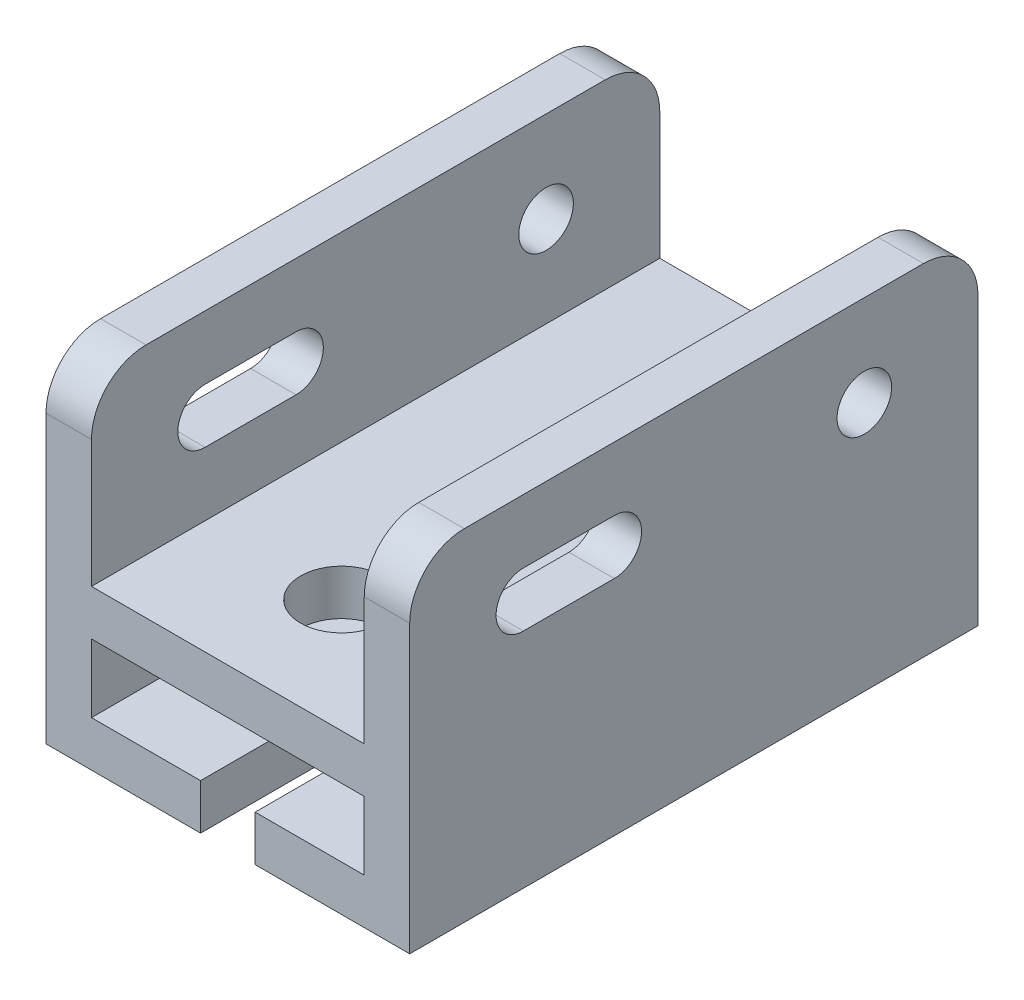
ISO-10303-21;
HEADER;
FILE_DESCRIPTION(('STEP AP214'),'2;1');
FILE_NAME('part.step','',(''),(''),'','','');
FILE_SCHEMA(('AUTOMOTIVE_DESIGN { 1 0 10303 214 1 1 1 1 }'));
ENDSEC;
DATA;
#1=APPLICATION_CONTEXT('core data for automotive mechanical design processes');
#2=APPLICATION_PROTOCOL_DEFINITION('international standard','automotive_design',2000,#1);
#3=PRODUCT_CONTEXT('',#1,'mechanical');
#4=PRODUCT('Part','Part','',(#3));
#5=PRODUCT_RELATED_PRODUCT_CATEGORY('part','',(#4));
#6=PRODUCT_DEFINITION_FORMATION('','',#4);
#7=PRODUCT_DEFINITION_CONTEXT('part definition',#1,'design');
#8=PRODUCT_DEFINITION('design','',#6,#7);
#9=PRODUCT_DEFINITION_SHAPE('','',#8);
#10=(LENGTH_UNIT() NAMED_UNIT(*) SI_UNIT(.MILLI.,.METRE.));
#11=(NAMED_UNIT(*) PLANE_ANGLE_UNIT() SI_UNIT($,.RADIAN.));
#12=(NAMED_UNIT(*) SI_UNIT($,.STERADIAN.) SOLID_ANGLE_UNIT());
#13=UNCERTAINTY_MEASURE_WITH_UNIT(LENGTH_MEASURE(1.E-05),#10,'distance_accuracy_value','');
#14=(GEOMETRIC_REPRESENTATION_CONTEXT(3) GLOBAL_UNCERTAINTY_ASSIGNED_CONTEXT((#13)) GLOBAL_UNIT_ASSIGNED_CONTEXT((#10,
#11,#12)) REPRESENTATION_CONTEXT('',''));
#15=CARTESIAN_POINT('',(0.,0.,0.));
#16=DIRECTION('',(0.,0.,1.));
#17=DIRECTION('',(1.,0.,0.));
#18=AXIS2_PLACEMENT_3D('',#15,#16,#17);
#19=CARTESIAN_POINT('',(34.,0.,-125.));
#20=DIRECTION('',(0.,-1.,0.));
#21=DIRECTION('',(0.,0.,-1.));
#22=AXIS2_PLACEMENT_3D('',#19,#20,#21);
#23=PLANE('',#22);
#24=DIRECTION('',(1.,0.,0.));
#25=VECTOR('',#24,1.);
#26=CARTESIAN_POINT('',(34.,0.,0.));
#27=LINE('',#26,#25);
#28=CARTESIAN_POINT('',(0.,0.,0.));
#29=VERTEX_POINT('',#28);
#30=CARTESIAN_POINT('',(34.,0.,0.));
#31=VERTEX_POINT('',#30);
#32=EDGE_CURVE('E305',#29,#31,#27,.T.);
#33=ORIENTED_EDGE('',*,*,#32,.F.);
#34=DIRECTION('',(0.,0.,1.));
#35=VECTOR('',#34,1.);
#36=CARTESIAN_POINT('',(0.,0.,-125.));
#37=LINE('',#36,#35);
#38=CARTESIAN_POINT('',(0.,0.,-125.));
#39=VERTEX_POINT('',#38);
#40=EDGE_CURVE('E386',#39,#29,#37,.T.);
#41=ORIENTED_EDGE('',*,*,#40,.F.);
#42=DIRECTION('',(1.,0.,0.));
#43=VECTOR('',#42,1.);
#44=CARTESIAN_POINT('',(34.,0.,-125.));
#45=LINE('',#44,#43);
#46=CARTESIAN_POINT('',(34.,0.,-125.));
#47=VERTEX_POINT('',#46);
#48=EDGE_CURVE('E345',#39,#47,#45,.T.);
#49=ORIENTED_EDGE('',*,*,#48,.T.);
#50=DIRECTION('',(0.,0.,1.));
#51=VECTOR('',#50,1.);
#52=CARTESIAN_POINT('',(34.,0.,-125.));
#53=LINE('',#52,#51);
#54=EDGE_CURVE('E385',#47,#31,#53,.T.);
#55=ORIENTED_EDGE('',*,*,#54,.T.);
#56=EDGE_LOOP('',(#33,#41,#49,#55));
#57=FACE_BOUND('',#56,.T.);
#58=ADVANCED_FACE('F26',(#57),#23,.T.);
#59=CARTESIAN_POINT('',(0.,0.,-125.));
#60=DIRECTION('',(-1.,0.,0.));
#61=DIRECTION('',(0.,0.,1.));
#62=AXIS2_PLACEMENT_3D('',#59,#60,#61);
#63=PLANE('',#62);
#64=CARTESIAN_POINT('',(0.,55.,-45.));
#65=DIRECTION('',(1.,0.,0.));
#66=DIRECTION('',(0.,0.,-1.));
#67=AXIS2_PLACEMENT_3D('',#64,#65,#66);
#68=CIRCLE('',#67,6.);
#69=CARTESIAN_POINT('',(0.,49.,-45.));
#70=VERTEX_POINT('',#69);
#71=CARTESIAN_POINT('',(0.,61.,-45.));
#72=VERTEX_POINT('',#71);
#73=EDGE_CURVE('E240',#70,#72,#68,.T.);
#74=ORIENTED_EDGE('',*,*,#73,.T.);
#75=DIRECTION('',(0.,0.,1.));
#76=VECTOR('',#75,1.);
#77=CARTESIAN_POINT('',(0.,61.,-45.));
#78=LINE('',#77,#76);
#79=CARTESIAN_POINT('',(0.,61.,-25.));
#80=VERTEX_POINT('',#79);
#81=EDGE_CURVE('E246',#72,#80,#78,.T.);
#82=ORIENTED_EDGE('',*,*,#81,.T.);
#83=CARTESIAN_POINT('',(0.,55.,-25.));
#84=DIRECTION('',(1.,0.,0.));
#85=DIRECTION('',(0.,0.,-1.));
#86=AXIS2_PLACEMENT_3D('',#83,#84,#85);
#87=CIRCLE('',#86,6.);
#88=CARTESIAN_POINT('',(0.,49.,-25.));
#89=VERTEX_POINT('',#88);
#90=EDGE_CURVE('E249',#80,#89,#87,.T.);
#91=ORIENTED_EDGE('',*,*,#90,.T.);
#92=DIRECTION('',(0.,0.,-1.));
#93=VECTOR('',#92,1.);
#94=CARTESIAN_POINT('',(0.,49.,-25.));
#95=LINE('',#94,#93);
#96=EDGE_CURVE('E252',#89,#70,#95,.T.);
#97=ORIENTED_EDGE('',*,*,#96,.T.);
#98=EDGE_LOOP('',(#74,#82,#91,#97));
#99=FACE_BOUND('',#98,.T.);
#100=CARTESIAN_POINT('',(0.,55.,-100.));
#101=DIRECTION('',(1.,0.,0.));
#102=DIRECTION('',(0.,0.,-1.));
#103=AXIS2_PLACEMENT_3D('',#100,#101,#102);
#104=CIRCLE('',#103,6.);
#105=CARTESIAN_POINT('',(0.,55.,-106.));
#106=VERTEX_POINT('',#105);
#107=EDGE_CURVE('E284',#106,#106,#104,.T.);
#108=ORIENTED_EDGE('',*,*,#107,.T.);
#109=EDGE_LOOP('',(#108));
#110=FACE_BOUND('',#109,.T.);
#111=DIRECTION('',(0.,0.,1.));
#112=VECTOR('',#111,1.);
#113=CARTESIAN_POINT('',(0.,75.,-125.));
#114=LINE('',#113,#112);
#115=CARTESIAN_POINT('',(0.,75.,-113.));
#116=VERTEX_POINT('',#115);
#117=CARTESIAN_POINT('',(0.,75.,-12.));
#118=VERTEX_POINT('',#117);
#119=EDGE_CURVE('E390',#116,#118,#114,.T.);
#120=ORIENTED_EDGE('',*,*,#119,.F.);
#121=CARTESIAN_POINT('',(0.,63.,-113.));
#122=DIRECTION('',(-1.,0.,0.));
#123=DIRECTION('',(0.,0.,1.));
#124=AXIS2_PLACEMENT_3D('',#121,#122,#123);
#125=CIRCLE('',#124,12.);
#126=CARTESIAN_POINT('',(0.,63.,-125.));
#127=VERTEX_POINT('',#126);
#128=EDGE_CURVE('E48',#116,#127,#125,.T.);
#129=ORIENTED_EDGE('',*,*,#128,.T.);
#130=DIRECTION('',(0.,-1.,0.));
#131=VECTOR('',#130,1.);
#132=CARTESIAN_POINT('',(0.,0.,-125.));
#133=LINE('',#132,#131);
#134=EDGE_CURVE('E383',#127,#39,#133,.T.);
#135=ORIENTED_EDGE('',*,*,#134,.T.);
#136=ORIENTED_EDGE('',*,*,#40,.T.);
#137=DIRECTION('',(0.,-1.,0.));
#138=VECTOR('',#137,1.);
#139=CARTESIAN_POINT('',(0.,0.,0.));
#140=LINE('',#139,#138);
#141=CARTESIAN_POINT('',(0.,63.,0.));
#142=VERTEX_POINT('',#141);
#143=EDGE_CURVE('E343',#142,#29,#140,.T.);
#144=ORIENTED_EDGE('',*,*,#143,.F.);
#145=CARTESIAN_POINT('',(0.,63.,-12.));
#146=DIRECTION('',(-1.,0.,0.));
#147=DIRECTION('',(0.,0.,1.));
#148=AXIS2_PLACEMENT_3D('',#145,#146,#147);
#149=CIRCLE('',#148,12.);
#150=EDGE_CURVE('E40',#142,#118,#149,.T.);
#151=ORIENTED_EDGE('',*,*,#150,.T.);
#152=EDGE_LOOP('',(#120,#129,#135,#136,#144,#151));
#153=FACE_BOUND('',#152,.T.);
#154=ADVANCED_FACE('F464',(#99,#110,#153),#63,.T.);
#155=CARTESIAN_POINT('',(0.,75.,-125.));
#156=DIRECTION('',(0.,1.,0.));
#157=DIRECTION('',(0.,0.,1.));
#158=AXIS2_PLACEMENT_3D('',#155,#156,#157);
#159=PLANE('',#158);
#160=DIRECTION('',(0.,0.,1.));
#161=VECTOR('',#160,1.);
#162=CARTESIAN_POINT('',(10.,75.,-125.));
#163=LINE('',#162,#161);
#164=CARTESIAN_POINT('',(10.,75.,-113.));
#165=VERTEX_POINT('',#164);
#166=CARTESIAN_POINT('',(10.,75.,-12.));
#167=VERTEX_POINT('',#166);
#168=EDGE_CURVE('E392',#165,#167,#163,.T.);
#169=ORIENTED_EDGE('',*,*,#168,.F.);
#170=DIRECTION('',(-1.,0.,0.));
#171=VECTOR('',#170,1.);
#172=CARTESIAN_POINT('',(0.,75.,-113.));
#173=LINE('',#172,#171);
#174=EDGE_CURVE('E447',#165,#116,#173,.T.);
#175=ORIENTED_EDGE('',*,*,#174,.T.);
#176=ORIENTED_EDGE('',*,*,#119,.T.);
#177=DIRECTION('',(-1.,0.,0.));
#178=VECTOR('',#177,1.);
#179=CARTESIAN_POINT('',(10.,75.,-12.));
#180=LINE('',#179,#178);
#181=EDGE_CURVE('E445',#118,#167,#180,.F.);
#182=ORIENTED_EDGE('',*,*,#181,.T.);
#183=EDGE_LOOP('',(#169,#175,#176,#182));
#184=FACE_BOUND('',#183,.T.);
#185=ADVANCED_FACE('F463',(#184),#159,.T.);
#186=CARTESIAN_POINT('',(10.,75.,-125.));
#187=DIRECTION('',(1.,0.,0.));
#188=DIRECTION('',(0.,1.,0.));
#189=AXIS2_PLACEMENT_3D('',#186,#187,#188);
#190=PLANE('',#189);
#191=CARTESIAN_POINT('',(10.,55.,-45.));
#192=DIRECTION('',(1.,0.,0.));
#193=DIRECTION('',(0.,1.,0.));
#194=AXIS2_PLACEMENT_3D('',#191,#192,#193);
#195=CIRCLE('',#194,6.);
#196=CARTESIAN_POINT('',(10.,49.,-45.));
#197=VERTEX_POINT('',#196);
#198=CARTESIAN_POINT('',(10.,61.,-45.));
#199=VERTEX_POINT('',#198);
#200=EDGE_CURVE('E278',#197,#199,#195,.T.);
#201=ORIENTED_EDGE('',*,*,#200,.F.);
#202=DIRECTION('',(0.,0.,-1.));
#203=VECTOR('',#202,1.);
#204=CARTESIAN_POINT('',(10.,49.,-125.));
#205=LINE('',#204,#203);
#206=CARTESIAN_POINT('',(10.,49.,-25.));
#207=VERTEX_POINT('',#206);
#208=EDGE_CURVE('E274',#207,#197,#205,.T.);
#209=ORIENTED_EDGE('',*,*,#208,.F.);
#210=CARTESIAN_POINT('',(10.,55.,-25.));
#211=DIRECTION('',(1.,0.,0.));
#212=DIRECTION('',(0.,1.,0.));
#213=AXIS2_PLACEMENT_3D('',#210,#211,#212);
#214=CIRCLE('',#213,6.);
#215=CARTESIAN_POINT('',(10.,61.,-25.));
#216=VERTEX_POINT('',#215);
#217=EDGE_CURVE('E270',#216,#207,#214,.T.);
#218=ORIENTED_EDGE('',*,*,#217,.F.);
#219=DIRECTION('',(0.,0.,1.));
#220=VECTOR('',#219,1.);
#221=CARTESIAN_POINT('',(10.,61.,-125.));
#222=LINE('',#221,#220);
#223=EDGE_CURVE('E267',#199,#216,#222,.T.);
#224=ORIENTED_EDGE('',*,*,#223,.F.);
#225=EDGE_LOOP('',(#201,#209,#218,#224));
#226=FACE_BOUND('',#225,.T.);
#227=CARTESIAN_POINT('',(10.,55.,-100.));
#228=DIRECTION('',(1.,0.,0.));
#229=DIRECTION('',(0.,1.,0.));
#230=AXIS2_PLACEMENT_3D('',#227,#228,#229);
#231=CIRCLE('',#230,6.);
#232=CARTESIAN_POINT('',(10.,61.,-100.));
#233=VERTEX_POINT('',#232);
#234=EDGE_CURVE('E290',#233,#233,#231,.T.);
#235=ORIENTED_EDGE('',*,*,#234,.F.);
#236=EDGE_LOOP('',(#235));
#237=FACE_BOUND('',#236,.T.);
#238=DIRECTION('',(0.,1.,0.));
#239=VECTOR('',#238,1.);
#240=CARTESIAN_POINT('',(10.,75.,-125.));
#241=LINE('',#240,#239);
#242=CARTESIAN_POINT('',(10.,35.,-125.));
#243=VERTEX_POINT('',#242);
#244=CARTESIAN_POINT('',(10.,63.,-125.));
#245=VERTEX_POINT('',#244);
#246=EDGE_CURVE('E380',#243,#245,#241,.T.);
#247=ORIENTED_EDGE('',*,*,#246,.T.);
#248=CARTESIAN_POINT('',(10.,63.,-113.));
#249=DIRECTION('',(1.,0.,0.));
#250=DIRECTION('',(0.,1.,0.));
#251=AXIS2_PLACEMENT_3D('',#248,#249,#250);
#252=CIRCLE('',#251,12.);
#253=EDGE_CURVE('E11',#245,#165,#252,.T.);
#254=ORIENTED_EDGE('',*,*,#253,.T.);
#255=ORIENTED_EDGE('',*,*,#168,.T.);
#256=CARTESIAN_POINT('',(10.,63.,-12.));
#257=DIRECTION('',(1.,0.,0.));
#258=DIRECTION('',(0.,1.,0.));
#259=AXIS2_PLACEMENT_3D('',#256,#257,#258);
#260=CIRCLE('',#259,12.);
#261=CARTESIAN_POINT('',(10.,63.,0.));
#262=VERTEX_POINT('',#261);
#263=EDGE_CURVE('E33',#167,#262,#260,.T.);
#264=ORIENTED_EDGE('',*,*,#263,.T.);
#265=DIRECTION('',(0.,1.,0.));
#266=VECTOR('',#265,1.);
#267=CARTESIAN_POINT('',(10.,75.,0.));
#268=LINE('',#267,#266);
#269=CARTESIAN_POINT('',(10.,35.,0.));
#270=VERTEX_POINT('',#269);
#271=EDGE_CURVE('E340',#270,#262,#268,.T.);
#272=ORIENTED_EDGE('',*,*,#271,.F.);
#273=DIRECTION('',(0.,0.,1.));
#274=VECTOR('',#273,1.);
#275=CARTESIAN_POINT('',(10.,35.,-125.));
#276=LINE('',#275,#274);
#277=EDGE_CURVE('E395',#243,#270,#276,.T.);
#278=ORIENTED_EDGE('',*,*,#277,.F.);
#279=EDGE_LOOP('',(#247,#254,#255,#264,#272,#278));
#280=FACE_BOUND('',#279,.T.);
#281=ADVANCED_FACE('F453',(#226,#237,#280),#190,.T.);
#282=CARTESIAN_POINT('',(10.,35.,-125.));
#283=DIRECTION('',(0.,1.,0.));
#284=DIRECTION('',(0.,0.,1.));
#285=AXIS2_PLACEMENT_3D('',#282,#283,#284);
#286=PLANE('',#285);
#287=CARTESIAN_POINT('',(40.,35.,-100.));
#288=DIRECTION('',(0.,1.,0.));
#289=DIRECTION('',(0.,0.,1.));
#290=AXIS2_PLACEMENT_3D('',#287,#288,#289);
#291=CIRCLE('',#290,9.);
#292=CARTESIAN_POINT('',(40.,35.,-91.));
#293=VERTEX_POINT('',#292);
#294=EDGE_CURVE('E296',#293,#293,#291,.T.);
#295=ORIENTED_EDGE('',*,*,#294,.F.);
#296=EDGE_LOOP('',(#295));
#297=FACE_BOUND('',#296,.T.);
#298=CARTESIAN_POINT('',(40.,35.,-25.));
#299=DIRECTION('',(0.,1.,0.));
#300=DIRECTION('',(0.,0.,1.));
#301=AXIS2_PLACEMENT_3D('',#298,#299,#300);
#302=CIRCLE('',#301,9.);
#303=CARTESIAN_POINT('',(40.,35.,-16.));
#304=VERTEX_POINT('',#303);
#305=EDGE_CURVE('E302',#304,#304,#302,.T.);
#306=ORIENTED_EDGE('',*,*,#305,.F.);
#307=EDGE_LOOP('',(#306));
#308=FACE_BOUND('',#307,.T.);
#309=DIRECTION('',(-1.,0.,0.));
#310=VECTOR('',#309,1.);
#311=CARTESIAN_POINT('',(10.,35.,0.));
#312=LINE('',#311,#310);
#313=CARTESIAN_POINT('',(70.,35.,0.));
#314=VERTEX_POINT('',#313);
#315=EDGE_CURVE('E337',#314,#270,#312,.T.);
#316=ORIENTED_EDGE('',*,*,#315,.F.);
#317=DIRECTION('',(0.,0.,1.));
#318=VECTOR('',#317,1.);
#319=CARTESIAN_POINT('',(70.,35.,-125.));
#320=LINE('',#319,#318);
#321=CARTESIAN_POINT('',(70.,35.,-125.));
#322=VERTEX_POINT('',#321);
#323=EDGE_CURVE('E397',#322,#314,#320,.T.);
#324=ORIENTED_EDGE('',*,*,#323,.F.);
#325=DIRECTION('',(-1.,0.,0.));
#326=VECTOR('',#325,1.);
#327=CARTESIAN_POINT('',(10.,35.,-125.));
#328=LINE('',#327,#326);
#329=EDGE_CURVE('E377',#322,#243,#328,.T.);
#330=ORIENTED_EDGE('',*,*,#329,.T.);
#331=ORIENTED_EDGE('',*,*,#277,.T.);
#332=EDGE_LOOP('',(#316,#324,#330,#331));
#333=FACE_BOUND('',#332,.T.);
#334=ADVANCED_FACE('F478',(#297,#308,#333),#286,.T.);
#335=CARTESIAN_POINT('',(70.,35.,-125.));
#336=DIRECTION('',(-1.,0.,0.));
#337=DIRECTION('',(0.,0.,1.));
#338=AXIS2_PLACEMENT_3D('',#335,#336,#337);
#339=PLANE('',#338);
#340=CARTESIAN_POINT('',(70.,55.,-45.));
#341=DIRECTION('',(-1.,0.,0.));
#342=DIRECTION('',(0.,0.,1.));
#343=AXIS2_PLACEMENT_3D('',#340,#341,#342);
#344=CIRCLE('',#343,6.);
#345=CARTESIAN_POINT('',(70.,61.,-45.));
#346=VERTEX_POINT('',#345);
#347=CARTESIAN_POINT('',(70.,49.,-45.));
#348=VERTEX_POINT('',#347);
#349=EDGE_CURVE('E276',#346,#348,#344,.T.);
#350=ORIENTED_EDGE('',*,*,#349,.F.);
#351=DIRECTION('',(0.,0.,-1.));
#352=VECTOR('',#351,1.);
#353=CARTESIAN_POINT('',(70.,61.,-125.));
#354=LINE('',#353,#352);
#355=CARTESIAN_POINT('',(70.,61.,-25.));
#356=VERTEX_POINT('',#355);
#357=EDGE_CURVE('E258',#356,#346,#354,.T.);
#358=ORIENTED_EDGE('',*,*,#357,.F.);
#359=CARTESIAN_POINT('',(70.,55.,-25.));
#360=DIRECTION('',(-1.,0.,0.));
#361=DIRECTION('',(0.,0.,1.));
#362=AXIS2_PLACEMENT_3D('',#359,#360,#361);
#363=CIRCLE('',#362,6.);
#364=CARTESIAN_POINT('',(70.,49.,-25.));
#365=VERTEX_POINT('',#364);
#366=EDGE_CURVE('E219',#365,#356,#363,.T.);
#367=ORIENTED_EDGE('',*,*,#366,.F.);
#368=DIRECTION('',(0.,0.,1.));
#369=VECTOR('',#368,1.);
#370=CARTESIAN_POINT('',(70.,49.,-125.));
#371=LINE('',#370,#369);
#372=EDGE_CURVE('E272',#348,#365,#371,.T.);
#373=ORIENTED_EDGE('',*,*,#372,.F.);
#374=EDGE_LOOP('',(#350,#358,#367,#373));
#375=FACE_BOUND('',#374,.T.);
#376=CARTESIAN_POINT('',(70.,55.,-100.));
#377=DIRECTION('',(-1.,0.,0.));
#378=DIRECTION('',(0.,0.,1.));
#379=AXIS2_PLACEMENT_3D('',#376,#377,#378);
#380=CIRCLE('',#379,6.);
#381=CARTESIAN_POINT('',(70.,55.,-94.));
#382=VERTEX_POINT('',#381);
#383=EDGE_CURVE('E287',#382,#382,#380,.T.);
#384=ORIENTED_EDGE('',*,*,#383,.F.);
#385=EDGE_LOOP('',(#384));
#386=FACE_BOUND('',#385,.T.);
#387=DIRECTION('',(0.,-1.,0.));
#388=VECTOR('',#387,1.);
#389=CARTESIAN_POINT('',(70.,35.,0.));
#390=LINE('',#389,#388);
#391=CARTESIAN_POINT('',(70.,63.,0.));
#392=VERTEX_POINT('',#391);
#393=EDGE_CURVE('E335',#392,#314,#390,.T.);
#394=ORIENTED_EDGE('',*,*,#393,.F.);
#395=CARTESIAN_POINT('',(70.,63.,-12.));
#396=DIRECTION('',(-1.,0.,0.));
#397=DIRECTION('',(0.,0.,1.));
#398=AXIS2_PLACEMENT_3D('',#395,#396,#397);
#399=CIRCLE('',#398,12.);
#400=CARTESIAN_POINT('',(70.,75.,-12.));
#401=VERTEX_POINT('',#400);
#402=EDGE_CURVE('E430',#392,#401,#399,.T.);
#403=ORIENTED_EDGE('',*,*,#402,.T.);
#404=DIRECTION('',(0.,0.,1.));
#405=VECTOR('',#404,1.);
#406=CARTESIAN_POINT('',(70.,75.,-125.));
#407=LINE('',#406,#405);
#408=CARTESIAN_POINT('',(70.,75.,-113.));
#409=VERTEX_POINT('',#408);
#410=EDGE_CURVE('E400',#409,#401,#407,.T.);
#411=ORIENTED_EDGE('',*,*,#410,.F.);
#412=CARTESIAN_POINT('',(70.,63.,-113.));
#413=DIRECTION('',(-1.,0.,0.));
#414=DIRECTION('',(0.,0.,1.));
#415=AXIS2_PLACEMENT_3D('',#412,#413,#414);
#416=CIRCLE('',#415,12.);
#417=CARTESIAN_POINT('',(70.,63.,-125.));
#418=VERTEX_POINT('',#417);
#419=EDGE_CURVE('E428',#409,#418,#416,.T.);
#420=ORIENTED_EDGE('',*,*,#419,.T.);
#421=DIRECTION('',(0.,-1.,0.));
#422=VECTOR('',#421,1.);
#423=CARTESIAN_POINT('',(70.,35.,-125.));
#424=LINE('',#423,#422);
#425=EDGE_CURVE('E375',#418,#322,#424,.T.);
#426=ORIENTED_EDGE('',*,*,#425,.T.);
#427=ORIENTED_EDGE('',*,*,#323,.T.);
#428=EDGE_LOOP('',(#394,#403,#411,#420,#426,#427));
#429=FACE_BOUND('',#428,.T.);
#430=ADVANCED_FACE('F481',(#375,#386,#429),#339,.T.);
#431=CARTESIAN_POINT('',(70.,75.,-125.));
#432=DIRECTION('',(0.,1.,0.));
#433=DIRECTION('',(0.,0.,1.));
#434=AXIS2_PLACEMENT_3D('',#431,#432,#433);
#435=PLANE('',#434);
#436=ORIENTED_EDGE('',*,*,#410,.T.);
#437=DIRECTION('',(-1.,0.,0.));
#438=VECTOR('',#437,1.);
#439=CARTESIAN_POINT('',(80.,75.,-12.));
#440=LINE('',#439,#438);
#441=CARTESIAN_POINT('',(80.,75.,-12.));
#442=VERTEX_POINT('',#441);
#443=EDGE_CURVE('E435',#401,#442,#440,.F.);
#444=ORIENTED_EDGE('',*,*,#443,.T.);
#445=DIRECTION('',(0.,0.,1.));
#446=VECTOR('',#445,1.);
#447=CARTESIAN_POINT('',(80.,75.,-125.));
#448=LINE('',#447,#446);
#449=CARTESIAN_POINT('',(80.,75.,-113.));
#450=VERTEX_POINT('',#449);
#451=EDGE_CURVE('E403',#450,#442,#448,.T.);
#452=ORIENTED_EDGE('',*,*,#451,.F.);
#453=DIRECTION('',(-1.,0.,0.));
#454=VECTOR('',#453,1.);
#455=CARTESIAN_POINT('',(70.,75.,-113.));
#456=LINE('',#455,#454);
#457=EDGE_CURVE('E432',#450,#409,#456,.T.);
#458=ORIENTED_EDGE('',*,*,#457,.T.);
#459=EDGE_LOOP('',(#436,#444,#452,#458));
#460=FACE_BOUND('',#459,.T.);
#461=ADVANCED_FACE('F493',(#460),#435,.T.);
#462=CARTESIAN_POINT('',(80.,75.,-125.));
#463=DIRECTION('',(1.,0.,0.));
#464=DIRECTION('',(0.,0.,-1.));
#465=AXIS2_PLACEMENT_3D('',#462,#463,#464);
#466=PLANE('',#465);
#467=CARTESIAN_POINT('',(80.,55.,-45.));
#468=DIRECTION('',(1.,0.,0.));
#469=DIRECTION('',(0.,0.,-1.));
#470=AXIS2_PLACEMENT_3D('',#467,#468,#469);
#471=CIRCLE('',#470,6.);
#472=CARTESIAN_POINT('',(80.,49.,-45.));
#473=VERTEX_POINT('',#472);
#474=CARTESIAN_POINT('',(80.,61.,-45.));
#475=VERTEX_POINT('',#474);
#476=EDGE_CURVE('E233',#473,#475,#471,.T.);
#477=ORIENTED_EDGE('',*,*,#476,.F.);
#478=DIRECTION('',(0.,0.,-1.));
#479=VECTOR('',#478,1.);
#480=CARTESIAN_POINT('',(80.,49.,-25.));
#481=LINE('',#480,#479);
#482=CARTESIAN_POINT('',(80.,49.,-25.));
#483=VERTEX_POINT('',#482);
#484=EDGE_CURVE('E238',#483,#473,#481,.T.);
#485=ORIENTED_EDGE('',*,*,#484,.F.);
#486=CARTESIAN_POINT('',(80.,55.,-25.));
#487=DIRECTION('',(1.,0.,0.));
#488=DIRECTION('',(0.,0.,-1.));
#489=AXIS2_PLACEMENT_3D('',#486,#487,#488);
#490=CIRCLE('',#489,6.);
#491=CARTESIAN_POINT('',(80.,61.,-25.));
#492=VERTEX_POINT('',#491);
#493=EDGE_CURVE('E216',#492,#483,#490,.T.);
#494=ORIENTED_EDGE('',*,*,#493,.F.);
#495=DIRECTION('',(0.,0.,1.));
#496=VECTOR('',#495,1.);
#497=CARTESIAN_POINT('',(80.,61.,-45.));
#498=LINE('',#497,#496);
#499=EDGE_CURVE('E227',#475,#492,#498,.T.);
#500=ORIENTED_EDGE('',*,*,#499,.F.);
#501=EDGE_LOOP('',(#477,#485,#494,#500));
#502=FACE_BOUND('',#501,.T.);
#503=CARTESIAN_POINT('',(80.,55.,-100.));
#504=DIRECTION('',(1.,0.,0.));
#505=DIRECTION('',(0.,0.,-1.));
#506=AXIS2_PLACEMENT_3D('',#503,#504,#505);
#507=CIRCLE('',#506,6.);
#508=CARTESIAN_POINT('',(80.,55.,-106.));
#509=VERTEX_POINT('',#508);
#510=EDGE_CURVE('E281',#509,#509,#507,.T.);
#511=ORIENTED_EDGE('',*,*,#510,.F.);
#512=EDGE_LOOP('',(#511));
#513=FACE_BOUND('',#512,.T.);
#514=ORIENTED_EDGE('',*,*,#451,.T.);
#515=CARTESIAN_POINT('',(80.,63.,-12.));
#516=DIRECTION('',(1.,0.,0.));
#517=DIRECTION('',(0.,0.,-1.));
#518=AXIS2_PLACEMENT_3D('',#515,#516,#517);
#519=CIRCLE('',#518,12.);
#520=CARTESIAN_POINT('',(80.,63.,0.));
#521=VERTEX_POINT('',#520);
#522=EDGE_CURVE('E439',#442,#521,#519,.T.);
#523=ORIENTED_EDGE('',*,*,#522,.T.);
#524=DIRECTION('',(0.,1.,0.));
#525=VECTOR('',#524,1.);
#526=CARTESIAN_POINT('',(80.,75.,0.));
#527=LINE('',#526,#525);
#528=CARTESIAN_POINT('',(80.,0.,0.));
#529=VERTEX_POINT('',#528);
#530=EDGE_CURVE('E332',#529,#521,#527,.T.);
#531=ORIENTED_EDGE('',*,*,#530,.F.);
#532=DIRECTION('',(0.,0.,1.));
#533=VECTOR('',#532,1.);
#534=CARTESIAN_POINT('',(80.,0.,-125.));
#535=LINE('',#534,#533);
#536=CARTESIAN_POINT('',(80.,0.,-125.));
#537=VERTEX_POINT('',#536);
#538=EDGE_CURVE('E406',#537,#529,#535,.T.);
#539=ORIENTED_EDGE('',*,*,#538,.F.);
#540=DIRECTION('',(0.,1.,0.));
#541=VECTOR('',#540,1.);
#542=CARTESIAN_POINT('',(80.,75.,-125.));
#543=LINE('',#542,#541);
#544=CARTESIAN_POINT('',(80.,63.,-125.));
#545=VERTEX_POINT('',#544);
#546=EDGE_CURVE('E372',#537,#545,#543,.T.);
#547=ORIENTED_EDGE('',*,*,#546,.T.);
#548=CARTESIAN_POINT('',(80.,63.,-113.));
#549=DIRECTION('',(1.,0.,0.));
#550=DIRECTION('',(0.,0.,-1.));
#551=AXIS2_PLACEMENT_3D('',#548,#549,#550);
#552=CIRCLE('',#551,12.);
#553=EDGE_CURVE('E437',#545,#450,#552,.T.);
#554=ORIENTED_EDGE('',*,*,#553,.T.);
#555=EDGE_LOOP('',(#514,#523,#531,#539,#547,#554));
#556=FACE_BOUND('',#555,.T.);
#557=ADVANCED_FACE('F235',(#502,#513,#556),#466,.T.);
#558=CARTESIAN_POINT('',(80.,0.,-125.));
#559=DIRECTION('',(0.,-1.,0.));
#560=DIRECTION('',(0.,0.,-1.));
#561=AXIS2_PLACEMENT_3D('',#558,#559,#560);
#562=PLANE('',#561);
#563=DIRECTION('',(1.,0.,0.));
#564=VECTOR('',#563,1.);
#565=CARTESIAN_POINT('',(80.,0.,0.));
#566=LINE('',#565,#564);
#567=CARTESIAN_POINT('',(46.,0.,0.));
#568=VERTEX_POINT('',#567);
#569=EDGE_CURVE('E329',#568,#529,#566,.T.);
#570=ORIENTED_EDGE('',*,*,#569,.F.);
#571=DIRECTION('',(0.,0.,1.));
#572=VECTOR('',#571,1.);
#573=CARTESIAN_POINT('',(46.,0.,-125.));
#574=LINE('',#573,#572);
#575=CARTESIAN_POINT('',(46.,0.,-125.));
#576=VERTEX_POINT('',#575);
#577=EDGE_CURVE('E408',#576,#568,#574,.T.);
#578=ORIENTED_EDGE('',*,*,#577,.F.);
#579=DIRECTION('',(1.,0.,0.));
#580=VECTOR('',#579,1.);
#581=CARTESIAN_POINT('',(80.,0.,-125.));
#582=LINE('',#581,#580);
#583=EDGE_CURVE('E369',#576,#537,#582,.T.);
#584=ORIENTED_EDGE('',*,*,#583,.T.);
#585=ORIENTED_EDGE('',*,*,#538,.T.);
#586=EDGE_LOOP('',(#570,#578,#584,#585));
#587=FACE_BOUND('',#586,.T.);
#588=ADVANCED_FACE('F502',(#587),#562,.T.);
#589=CARTESIAN_POINT('',(46.,0.,-125.));
#590=DIRECTION('',(-1.,0.,0.));
#591=DIRECTION('',(0.,0.,1.));
#592=AXIS2_PLACEMENT_3D('',#589,#590,#591);
#593=PLANE('',#592);
#594=DIRECTION('',(0.,-1.,0.));
#595=VECTOR('',#594,1.);
#596=CARTESIAN_POINT('',(46.,0.,0.));
#597=LINE('',#596,#595);
#598=CARTESIAN_POINT('',(46.,10.,0.));
#599=VERTEX_POINT('',#598);
#600=EDGE_CURVE('E326',#599,#568,#597,.T.);
#601=ORIENTED_EDGE('',*,*,#600,.F.);
#602=DIRECTION('',(0.,0.,1.));
#603=VECTOR('',#602,1.);
#604=CARTESIAN_POINT('',(46.,10.,-125.));
#605=LINE('',#604,#603);
#606=CARTESIAN_POINT('',(46.,10.,-125.));
#607=VERTEX_POINT('',#606);
#608=EDGE_CURVE('E410',#607,#599,#605,.T.);
#609=ORIENTED_EDGE('',*,*,#608,.F.);
#610=DIRECTION('',(0.,-1.,0.));
#611=VECTOR('',#610,1.);
#612=CARTESIAN_POINT('',(46.,0.,-125.));
#613=LINE('',#612,#611);
#614=EDGE_CURVE('E366',#607,#576,#613,.T.);
#615=ORIENTED_EDGE('',*,*,#614,.T.);
#616=ORIENTED_EDGE('',*,*,#577,.T.);
#617=EDGE_LOOP('',(#601,#609,#615,#616));
#618=FACE_BOUND('',#617,.T.);
#619=ADVANCED_FACE('F507',(#618),#593,.T.);
#620=CARTESIAN_POINT('',(46.,10.,-125.));
#621=DIRECTION('',(0.,1.,0.));
#622=DIRECTION('',(0.,0.,1.));
#623=AXIS2_PLACEMENT_3D('',#620,#621,#622);
#624=PLANE('',#623);
#625=DIRECTION('',(-1.,0.,0.));
#626=VECTOR('',#625,1.);
#627=CARTESIAN_POINT('',(46.,10.,0.));
#628=LINE('',#627,#626);
#629=CARTESIAN_POINT('',(70.,10.,0.));
#630=VERTEX_POINT('',#629);
#631=EDGE_CURVE('E323',#630,#599,#628,.T.);
#632=ORIENTED_EDGE('',*,*,#631,.F.);
#633=DIRECTION('',(0.,0.,1.));
#634=VECTOR('',#633,1.);
#635=CARTESIAN_POINT('',(70.,10.,-125.));
#636=LINE('',#635,#634);
#637=CARTESIAN_POINT('',(70.,10.,-125.));
#638=VERTEX_POINT('',#637);
#639=EDGE_CURVE('E412',#638,#630,#636,.T.);
#640=ORIENTED_EDGE('',*,*,#639,.F.);
#641=DIRECTION('',(-1.,0.,0.));
#642=VECTOR('',#641,1.);
#643=CARTESIAN_POINT('',(46.,10.,-125.));
#644=LINE('',#643,#642);
#645=EDGE_CURVE('E363',#638,#607,#644,.T.);
#646=ORIENTED_EDGE('',*,*,#645,.T.);
#647=ORIENTED_EDGE('',*,*,#608,.T.);
#648=EDGE_LOOP('',(#632,#640,#646,#647));
#649=FACE_BOUND('',#648,.T.);
#650=ADVANCED_FACE('F510',(#649),#624,.T.);
#651=CARTESIAN_POINT('',(70.,10.,-125.));
#652=DIRECTION('',(-1.,0.,0.));
#653=DIRECTION('',(0.,0.,1.));
#654=AXIS2_PLACEMENT_3D('',#651,#652,#653);
#655=PLANE('',#654);
#656=DIRECTION('',(0.,-1.,0.));
#657=VECTOR('',#656,1.);
#658=CARTESIAN_POINT('',(70.,10.,0.));
#659=LINE('',#658,#657);
#660=CARTESIAN_POINT('',(70.,25.,0.));
#661=VERTEX_POINT('',#660);
#662=EDGE_CURVE('E320',#661,#630,#659,.T.);
#663=ORIENTED_EDGE('',*,*,#662,.F.);
#664=DIRECTION('',(0.,0.,1.));
#665=VECTOR('',#664,1.);
#666=CARTESIAN_POINT('',(70.,25.,-125.));
#667=LINE('',#666,#665);
#668=CARTESIAN_POINT('',(70.,25.,-125.));
#669=VERTEX_POINT('',#668);
#670=EDGE_CURVE('E414',#669,#661,#667,.T.);
#671=ORIENTED_EDGE('',*,*,#670,.F.);
#672=DIRECTION('',(0.,-1.,0.));
#673=VECTOR('',#672,1.);
#674=CARTESIAN_POINT('',(70.,10.,-125.));
#675=LINE('',#674,#673);
#676=EDGE_CURVE('E360',#669,#638,#675,.T.);
#677=ORIENTED_EDGE('',*,*,#676,.T.);
#678=ORIENTED_EDGE('',*,*,#639,.T.);
#679=EDGE_LOOP('',(#663,#671,#677,#678));
#680=FACE_BOUND('',#679,.T.);
#681=ADVANCED_FACE('F515',(#680),#655,.T.);
#682=CARTESIAN_POINT('',(70.,25.,-125.));
#683=DIRECTION('',(0.,-1.,0.));
#684=DIRECTION('',(1.,0.,0.));
#685=AXIS2_PLACEMENT_3D('',#682,#683,#684);
#686=PLANE('',#685);
#687=CARTESIAN_POINT('',(40.,25.,-100.));
#688=DIRECTION('',(0.,-1.,0.));
#689=DIRECTION('',(1.,0.,0.));
#690=AXIS2_PLACEMENT_3D('',#687,#688,#689);
#691=CIRCLE('',#690,9.);
#692=CARTESIAN_POINT('',(49.,25.,-100.));
#693=VERTEX_POINT('',#692);
#694=EDGE_CURVE('E293',#693,#693,#691,.F.);
#695=ORIENTED_EDGE('',*,*,#694,.T.);
#696=EDGE_LOOP('',(#695));
#697=FACE_BOUND('',#696,.T.);
#698=CARTESIAN_POINT('',(40.,25.,-25.));
#699=DIRECTION('',(0.,-1.,0.));
#700=DIRECTION('',(1.,0.,0.));
#701=AXIS2_PLACEMENT_3D('',#698,#699,#700);
#702=CIRCLE('',#701,9.);
#703=CARTESIAN_POINT('',(49.,25.,-25.));
#704=VERTEX_POINT('',#703);
#705=EDGE_CURVE('E299',#704,#704,#702,.F.);
#706=ORIENTED_EDGE('',*,*,#705,.T.);
#707=EDGE_LOOP('',(#706));
#708=FACE_BOUND('',#707,.T.);
#709=DIRECTION('',(1.,0.,0.));
#710=VECTOR('',#709,1.);
#711=CARTESIAN_POINT('',(70.,25.,0.));
#712=LINE('',#711,#710);
#713=CARTESIAN_POINT('',(10.,25.,0.));
#714=VERTEX_POINT('',#713);
#715=EDGE_CURVE('E317',#714,#661,#712,.T.);
#716=ORIENTED_EDGE('',*,*,#715,.F.);
#717=DIRECTION('',(0.,0.,1.));
#718=VECTOR('',#717,1.);
#719=CARTESIAN_POINT('',(10.,25.,-125.));
#720=LINE('',#719,#718);
#721=CARTESIAN_POINT('',(10.,25.,-125.));
#722=VERTEX_POINT('',#721);
#723=EDGE_CURVE('E416',#722,#714,#720,.T.);
#724=ORIENTED_EDGE('',*,*,#723,.F.);
#725=DIRECTION('',(1.,0.,0.));
#726=VECTOR('',#725,1.);
#727=CARTESIAN_POINT('',(70.,25.,-125.));
#728=LINE('',#727,#726);
#729=EDGE_CURVE('E357',#722,#669,#728,.T.);
#730=ORIENTED_EDGE('',*,*,#729,.T.);
#731=ORIENTED_EDGE('',*,*,#670,.T.);
#732=EDGE_LOOP('',(#716,#724,#730,#731));
#733=FACE_BOUND('',#732,.T.);
#734=ADVANCED_FACE('F518',(#697,#708,#733),#686,.T.);
#735=CARTESIAN_POINT('',(10.,25.,-125.));
#736=DIRECTION('',(1.,0.,0.));
#737=DIRECTION('',(0.,1.,0.));
#738=AXIS2_PLACEMENT_3D('',#735,#736,#737);
#739=PLANE('',#738);
#740=DIRECTION('',(0.,1.,0.));
#741=VECTOR('',#740,1.);
#742=CARTESIAN_POINT('',(10.,25.,0.));
#743=LINE('',#742,#741);
#744=CARTESIAN_POINT('',(10.,10.,0.));
#745=VERTEX_POINT('',#744);
#746=EDGE_CURVE('E314',#745,#714,#743,.T.);
#747=ORIENTED_EDGE('',*,*,#746,.F.);
#748=DIRECTION('',(0.,0.,1.));
#749=VECTOR('',#748,1.);
#750=CARTESIAN_POINT('',(10.,10.,-125.));
#751=LINE('',#750,#749);
#752=CARTESIAN_POINT('',(10.,10.,-125.));
#753=VERTEX_POINT('',#752);
#754=EDGE_CURVE('E418',#753,#745,#751,.T.);
#755=ORIENTED_EDGE('',*,*,#754,.F.);
#756=DIRECTION('',(0.,1.,0.));
#757=VECTOR('',#756,1.);
#758=CARTESIAN_POINT('',(10.,25.,-125.));
#759=LINE('',#758,#757);
#760=EDGE_CURVE('E354',#753,#722,#759,.T.);
#761=ORIENTED_EDGE('',*,*,#760,.T.);
#762=ORIENTED_EDGE('',*,*,#723,.T.);
#763=EDGE_LOOP('',(#747,#755,#761,#762));
#764=FACE_BOUND('',#763,.T.);
#765=ADVANCED_FACE('F523',(#764),#739,.T.);
#766=CARTESIAN_POINT('',(10.,10.,-125.));
#767=DIRECTION('',(0.,1.,0.));
#768=DIRECTION('',(0.,0.,1.));
#769=AXIS2_PLACEMENT_3D('',#766,#767,#768);
#770=PLANE('',#769);
#771=DIRECTION('',(-1.,0.,0.));
#772=VECTOR('',#771,1.);
#773=CARTESIAN_POINT('',(10.,10.,0.));
#774=LINE('',#773,#772);
#775=CARTESIAN_POINT('',(34.,10.,0.));
#776=VERTEX_POINT('',#775);
#777=EDGE_CURVE('E311',#776,#745,#774,.T.);
#778=ORIENTED_EDGE('',*,*,#777,.F.);
#779=DIRECTION('',(0.,0.,1.));
#780=VECTOR('',#779,1.);
#781=CARTESIAN_POINT('',(34.,10.,-125.));
#782=LINE('',#781,#780);
#783=CARTESIAN_POINT('',(34.,10.,-125.));
#784=VERTEX_POINT('',#783);
#785=EDGE_CURVE('E420',#784,#776,#782,.T.);
#786=ORIENTED_EDGE('',*,*,#785,.F.);
#787=DIRECTION('',(-1.,0.,0.));
#788=VECTOR('',#787,1.);
#789=CARTESIAN_POINT('',(10.,10.,-125.));
#790=LINE('',#789,#788);
#791=EDGE_CURVE('E351',#784,#753,#790,.T.);
#792=ORIENTED_EDGE('',*,*,#791,.T.);
#793=ORIENTED_EDGE('',*,*,#754,.T.);
#794=EDGE_LOOP('',(#778,#786,#792,#793));
#795=FACE_BOUND('',#794,.T.);
#796=ADVANCED_FACE('F526',(#795),#770,.T.);
#797=CARTESIAN_POINT('',(34.,10.,-125.));
#798=DIRECTION('',(1.,0.,0.));
#799=DIRECTION('',(0.,0.,-1.));
#800=AXIS2_PLACEMENT_3D('',#797,#798,#799);
#801=PLANE('',#800);
#802=DIRECTION('',(0.,1.,0.));
#803=VECTOR('',#802,1.);
#804=CARTESIAN_POINT('',(34.,10.,0.));
#805=LINE('',#804,#803);
#806=EDGE_CURVE('E308',#31,#776,#805,.T.);
#807=ORIENTED_EDGE('',*,*,#806,.F.);
#808=ORIENTED_EDGE('',*,*,#54,.F.);
#809=DIRECTION('',(0.,1.,0.));
#810=VECTOR('',#809,1.);
#811=CARTESIAN_POINT('',(34.,10.,-125.));
#812=LINE('',#811,#810);
#813=EDGE_CURVE('E348',#47,#784,#812,.T.);
#814=ORIENTED_EDGE('',*,*,#813,.T.);
#815=ORIENTED_EDGE('',*,*,#785,.T.);
#816=EDGE_LOOP('',(#807,#808,#814,#815));
#817=FACE_BOUND('',#816,.T.);
#818=ADVANCED_FACE('F529',(#817),#801,.T.);
#819=CARTESIAN_POINT('',(0.,0.,-125.));
#820=DIRECTION('',(0.,0.,-1.));
#821=DIRECTION('',(-1.,0.,0.));
#822=AXIS2_PLACEMENT_3D('',#819,#820,#821);
#823=PLANE('',#822);
#824=ORIENTED_EDGE('',*,*,#425,.F.);
#825=DIRECTION('',(-1.,0.,0.));
#826=VECTOR('',#825,1.);
#827=CARTESIAN_POINT('',(0.,63.,-125.));
#828=LINE('',#827,#826);
#829=EDGE_CURVE('E443',#418,#545,#828,.F.);
#830=ORIENTED_EDGE('',*,*,#829,.T.);
#831=ORIENTED_EDGE('',*,*,#546,.F.);
#832=ORIENTED_EDGE('',*,*,#583,.F.);
#833=ORIENTED_EDGE('',*,*,#614,.F.);
#834=ORIENTED_EDGE('',*,*,#645,.F.);
#835=ORIENTED_EDGE('',*,*,#676,.F.);
#836=ORIENTED_EDGE('',*,*,#729,.F.);
#837=ORIENTED_EDGE('',*,*,#760,.F.);
#838=ORIENTED_EDGE('',*,*,#791,.F.);
#839=ORIENTED_EDGE('',*,*,#813,.F.);
#840=ORIENTED_EDGE('',*,*,#48,.F.);
#841=ORIENTED_EDGE('',*,*,#134,.F.);
#842=DIRECTION('',(-1.,0.,0.));
#843=VECTOR('',#842,1.);
#844=CARTESIAN_POINT('',(0.,63.,-125.));
#845=LINE('',#844,#843);
#846=EDGE_CURVE('E441',#127,#245,#845,.F.);
#847=ORIENTED_EDGE('',*,*,#846,.T.);
#848=ORIENTED_EDGE('',*,*,#246,.F.);
#849=ORIENTED_EDGE('',*,*,#329,.F.);
#850=EDGE_LOOP('',(#824,#830,#831,#832,#833,#834,#835,#836,#837,#838,#839,#840,#841,#847,#848,#849));
#851=FACE_BOUND('',#850,.T.);
#852=ADVANCED_FACE('F470',(#851),#823,.T.);
#853=CARTESIAN_POINT('',(0.,0.,0.));
#854=DIRECTION('',(0.,0.,-1.));
#855=DIRECTION('',(-1.,0.,0.));
#856=AXIS2_PLACEMENT_3D('',#853,#854,#855);
#857=PLANE('',#856);
#858=ORIENTED_EDGE('',*,*,#530,.T.);
#859=DIRECTION('',(-1.,0.,0.));
#860=VECTOR('',#859,1.);
#861=CARTESIAN_POINT('',(70.,63.,0.));
#862=LINE('',#861,#860);
#863=EDGE_CURVE('E425',#521,#392,#862,.T.);
#864=ORIENTED_EDGE('',*,*,#863,.T.);
#865=ORIENTED_EDGE('',*,*,#393,.T.);
#866=ORIENTED_EDGE('',*,*,#315,.T.);
#867=ORIENTED_EDGE('',*,*,#271,.T.);
#868=DIRECTION('',(-1.,0.,0.));
#869=VECTOR('',#868,1.);
#870=CARTESIAN_POINT('',(0.,63.,0.));
#871=LINE('',#870,#869);
#872=EDGE_CURVE('E389',#262,#142,#871,.T.);
#873=ORIENTED_EDGE('',*,*,#872,.T.);
#874=ORIENTED_EDGE('',*,*,#143,.T.);
#875=ORIENTED_EDGE('',*,*,#32,.T.);
#876=ORIENTED_EDGE('',*,*,#806,.T.);
#877=ORIENTED_EDGE('',*,*,#777,.T.);
#878=ORIENTED_EDGE('',*,*,#746,.T.);
#879=ORIENTED_EDGE('',*,*,#715,.T.);
#880=ORIENTED_EDGE('',*,*,#662,.T.);
#881=ORIENTED_EDGE('',*,*,#631,.T.);
#882=ORIENTED_EDGE('',*,*,#600,.T.);
#883=ORIENTED_EDGE('',*,*,#569,.T.);
#884=EDGE_LOOP('',(#858,#864,#865,#866,#867,#873,#874,#875,#876,#877,#878,#879,#880,#881,#882,#883));
#885=FACE_BOUND('',#884,.T.);
#886=ADVANCED_FACE('F459',(#885),#857,.F.);
#887=CARTESIAN_POINT('',(40.,-0.001000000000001,-25.));
#888=DIRECTION('',(0.,1.,0.));
#889=DIRECTION('',(0.,0.,1.));
#890=AXIS2_PLACEMENT_3D('',#887,#888,#889);
#891=CYLINDRICAL_SURFACE('',#890,9.);
#892=ORIENTED_EDGE('',*,*,#705,.F.);
#893=EDGE_LOOP('',(#892));
#894=FACE_BOUND('',#893,.T.);
#895=ORIENTED_EDGE('',*,*,#305,.T.);
#896=EDGE_LOOP('',(#895));
#897=FACE_BOUND('',#896,.T.);
#898=ADVANCED_FACE('F582',(#894,#897),#891,.F.);
#899=CARTESIAN_POINT('',(40.,-0.001000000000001,-100.));
#900=DIRECTION('',(0.,1.,0.));
#901=DIRECTION('',(0.,0.,1.));
#902=AXIS2_PLACEMENT_3D('',#899,#900,#901);
#903=CYLINDRICAL_SURFACE('',#902,9.);
#904=ORIENTED_EDGE('',*,*,#694,.F.);
#905=EDGE_LOOP('',(#904));
#906=FACE_BOUND('',#905,.T.);
#907=ORIENTED_EDGE('',*,*,#294,.T.);
#908=EDGE_LOOP('',(#907));
#909=FACE_BOUND('',#908,.T.);
#910=ADVANCED_FACE('F586',(#906,#909),#903,.F.);
#911=CARTESIAN_POINT('',(0.,55.,-100.));
#912=DIRECTION('',(1.,0.,0.));
#913=DIRECTION('',(0.,0.,-1.));
#914=AXIS2_PLACEMENT_3D('',#911,#912,#913);
#915=CYLINDRICAL_SURFACE('',#914,6.);
#916=ORIENTED_EDGE('',*,*,#383,.T.);
#917=EDGE_LOOP('',(#916));
#918=FACE_BOUND('',#917,.T.);
#919=ORIENTED_EDGE('',*,*,#510,.T.);
#920=EDGE_LOOP('',(#919));
#921=FACE_BOUND('',#920,.T.);
#922=ADVANCED_FACE('F592',(#918,#921),#915,.F.);
#923=ORIENTED_EDGE('',*,*,#234,.T.);
#924=EDGE_LOOP('',(#923));
#925=FACE_BOUND('',#924,.T.);
#926=ORIENTED_EDGE('',*,*,#107,.F.);
#927=EDGE_LOOP('',(#926));
#928=FACE_BOUND('',#927,.T.);
#929=ADVANCED_FACE('F596',(#925,#928),#915,.F.);
#930=CARTESIAN_POINT('',(0.,61.,-45.));
#931=DIRECTION('',(0.,1.,0.));
#932=DIRECTION('',(0.,0.,1.));
#933=AXIS2_PLACEMENT_3D('',#930,#931,#932);
#934=PLANE('',#933);
#935=ORIENTED_EDGE('',*,*,#357,.T.);
#936=DIRECTION('',(1.,0.,0.));
#937=VECTOR('',#936,1.);
#938=CARTESIAN_POINT('',(0.,61.,-45.));
#939=LINE('',#938,#937);
#940=EDGE_CURVE('E230',#346,#475,#939,.T.);
#941=ORIENTED_EDGE('',*,*,#940,.T.);
#942=ORIENTED_EDGE('',*,*,#499,.T.);
#943=DIRECTION('',(1.,0.,0.));
#944=VECTOR('',#943,1.);
#945=CARTESIAN_POINT('',(0.,61.,-25.));
#946=LINE('',#945,#944);
#947=EDGE_CURVE('E211',#356,#492,#946,.T.);
#948=ORIENTED_EDGE('',*,*,#947,.F.);
#949=EDGE_LOOP('',(#935,#941,#942,#948));
#950=FACE_BOUND('',#949,.T.);
#951=ADVANCED_FACE('F228',(#950),#934,.F.);
#952=CARTESIAN_POINT('',(0.,55.,-25.));
#953=DIRECTION('',(1.,0.,0.));
#954=DIRECTION('',(0.,0.,-1.));
#955=AXIS2_PLACEMENT_3D('',#952,#953,#954);
#956=CYLINDRICAL_SURFACE('',#955,6.);
#957=ORIENTED_EDGE('',*,*,#366,.T.);
#958=ORIENTED_EDGE('',*,*,#947,.T.);
#959=ORIENTED_EDGE('',*,*,#493,.T.);
#960=DIRECTION('',(1.,0.,0.));
#961=VECTOR('',#960,1.);
#962=CARTESIAN_POINT('',(0.,49.,-25.));
#963=LINE('',#962,#961);
#964=EDGE_CURVE('E262',#365,#483,#963,.T.);
#965=ORIENTED_EDGE('',*,*,#964,.F.);
#966=EDGE_LOOP('',(#957,#958,#959,#965));
#967=FACE_BOUND('',#966,.T.);
#968=ADVANCED_FACE('F213',(#967),#956,.F.);
#969=CARTESIAN_POINT('',(0.,49.,-25.));
#970=DIRECTION('',(0.,-1.,0.));
#971=DIRECTION('',(0.,0.,-1.));
#972=AXIS2_PLACEMENT_3D('',#969,#970,#971);
#973=PLANE('',#972);
#974=ORIENTED_EDGE('',*,*,#372,.T.);
#975=ORIENTED_EDGE('',*,*,#964,.T.);
#976=ORIENTED_EDGE('',*,*,#484,.T.);
#977=DIRECTION('',(1.,0.,0.));
#978=VECTOR('',#977,1.);
#979=CARTESIAN_POINT('',(0.,49.,-45.));
#980=LINE('',#979,#978);
#981=EDGE_CURVE('E259',#348,#473,#980,.T.);
#982=ORIENTED_EDGE('',*,*,#981,.F.);
#983=EDGE_LOOP('',(#974,#975,#976,#982));
#984=FACE_BOUND('',#983,.T.);
#985=ADVANCED_FACE('F602',(#984),#973,.F.);
#986=CARTESIAN_POINT('',(0.,55.,-45.));
#987=DIRECTION('',(1.,0.,0.));
#988=DIRECTION('',(0.,0.,-1.));
#989=AXIS2_PLACEMENT_3D('',#986,#987,#988);
#990=CYLINDRICAL_SURFACE('',#989,6.);
#991=ORIENTED_EDGE('',*,*,#349,.T.);
#992=ORIENTED_EDGE('',*,*,#981,.T.);
#993=ORIENTED_EDGE('',*,*,#476,.T.);
#994=ORIENTED_EDGE('',*,*,#940,.F.);
#995=EDGE_LOOP('',(#991,#992,#993,#994));
#996=FACE_BOUND('',#995,.T.);
#997=ADVANCED_FACE('F598',(#996),#990,.F.);
#998=ORIENTED_EDGE('',*,*,#200,.T.);
#999=EDGE_CURVE('E223',#72,#199,#939,.T.);
#1000=ORIENTED_EDGE('',*,*,#999,.F.);
#1001=ORIENTED_EDGE('',*,*,#73,.F.);
#1002=EDGE_CURVE('E255',#70,#197,#980,.T.);
#1003=ORIENTED_EDGE('',*,*,#1002,.T.);
#1004=EDGE_LOOP('',(#998,#1000,#1001,#1003));
#1005=FACE_BOUND('',#1004,.T.);
#1006=ADVANCED_FACE('F601',(#1005),#990,.F.);
#1007=ORIENTED_EDGE('',*,*,#208,.T.);
#1008=ORIENTED_EDGE('',*,*,#1002,.F.);
#1009=ORIENTED_EDGE('',*,*,#96,.F.);
#1010=EDGE_CURVE('E260',#89,#207,#963,.T.);
#1011=ORIENTED_EDGE('',*,*,#1010,.T.);
#1012=EDGE_LOOP('',(#1007,#1008,#1009,#1011));
#1013=FACE_BOUND('',#1012,.T.);
#1014=ADVANCED_FACE('F613',(#1013),#973,.F.);
#1015=ORIENTED_EDGE('',*,*,#217,.T.);
#1016=ORIENTED_EDGE('',*,*,#1010,.F.);
#1017=ORIENTED_EDGE('',*,*,#90,.F.);
#1018=EDGE_CURVE('E222',#80,#216,#946,.T.);
#1019=ORIENTED_EDGE('',*,*,#1018,.T.);
#1020=EDGE_LOOP('',(#1015,#1016,#1017,#1019));
#1021=FACE_BOUND('',#1020,.T.);
#1022=ADVANCED_FACE('F609',(#1021),#956,.F.);
#1023=ORIENTED_EDGE('',*,*,#223,.T.);
#1024=ORIENTED_EDGE('',*,*,#1018,.F.);
#1025=ORIENTED_EDGE('',*,*,#81,.F.);
#1026=ORIENTED_EDGE('',*,*,#999,.T.);
#1027=EDGE_LOOP('',(#1023,#1024,#1025,#1026));
#1028=FACE_BOUND('',#1027,.T.);
#1029=ADVANCED_FACE('F606',(#1028),#934,.F.);
#1030=CARTESIAN_POINT('',(0.,63.,-12.));
#1031=DIRECTION('',(1.,0.,0.));
#1032=DIRECTION('',(0.,0.,-1.));
#1033=AXIS2_PLACEMENT_3D('',#1030,#1031,#1032);
#1034=CYLINDRICAL_SURFACE('',#1033,12.);
#1035=ORIENTED_EDGE('',*,*,#522,.F.);
#1036=ORIENTED_EDGE('',*,*,#443,.F.);
#1037=ORIENTED_EDGE('',*,*,#402,.F.);
#1038=ORIENTED_EDGE('',*,*,#863,.F.);
#1039=EDGE_LOOP('',(#1035,#1036,#1037,#1038));
#1040=FACE_BOUND('',#1039,.T.);
#1041=ADVANCED_FACE('F496',(#1040),#1034,.T.);
#1042=CARTESIAN_POINT('',(70.,63.,-113.));
#1043=DIRECTION('',(-1.,0.,0.));
#1044=DIRECTION('',(0.,0.,1.));
#1045=AXIS2_PLACEMENT_3D('',#1042,#1043,#1044);
#1046=CYLINDRICAL_SURFACE('',#1045,12.);
#1047=ORIENTED_EDGE('',*,*,#553,.F.);
#1048=ORIENTED_EDGE('',*,*,#829,.F.);
#1049=ORIENTED_EDGE('',*,*,#419,.F.);
#1050=ORIENTED_EDGE('',*,*,#457,.F.);
#1051=EDGE_LOOP('',(#1047,#1048,#1049,#1050));
#1052=FACE_BOUND('',#1051,.T.);
#1053=ADVANCED_FACE('F487',(#1052),#1046,.T.);
#1054=CARTESIAN_POINT('',(0.,63.,-113.));
#1055=DIRECTION('',(-1.,0.,0.));
#1056=DIRECTION('',(0.,0.,1.));
#1057=AXIS2_PLACEMENT_3D('',#1054,#1055,#1056);
#1058=CYLINDRICAL_SURFACE('',#1057,12.);
#1059=ORIENTED_EDGE('',*,*,#253,.F.);
#1060=ORIENTED_EDGE('',*,*,#846,.F.);
#1061=ORIENTED_EDGE('',*,*,#128,.F.);
#1062=ORIENTED_EDGE('',*,*,#174,.F.);
#1063=EDGE_LOOP('',(#1059,#1060,#1061,#1062));
#1064=FACE_BOUND('',#1063,.T.);
#1065=ADVANCED_FACE('F474',(#1064),#1058,.T.);
#1066=CARTESIAN_POINT('',(0.,63.,-12.));
#1067=DIRECTION('',(1.,0.,0.));
#1068=DIRECTION('',(0.,0.,-1.));
#1069=AXIS2_PLACEMENT_3D('',#1066,#1067,#1068);
#1070=CYLINDRICAL_SURFACE('',#1069,12.);
#1071=ORIENTED_EDGE('',*,*,#263,.F.);
#1072=ORIENTED_EDGE('',*,*,#181,.F.);
#1073=ORIENTED_EDGE('',*,*,#150,.F.);
#1074=ORIENTED_EDGE('',*,*,#872,.F.);
#1075=EDGE_LOOP('',(#1071,#1072,#1073,#1074));
#1076=FACE_BOUND('',#1075,.T.);
#1077=ADVANCED_FACE('F461',(#1076),#1070,.T.);
#1078=CLOSED_SHELL('',(#58,#154,#185,#281,#334,#430,#461,#557,#588,#619,#650,#681,#734,#765,
#796,#818,#852,#886,#898,#910,#922,#929,#951,#968,#985,#997,#1006,#1014,#1022,#1029,#1041,#1053,
#1065,#1077));
#1079=MANIFOLD_SOLID_BREP('B2',#1078);
#1080=ADVANCED_BREP_SHAPE_REPRESENTATION('',(#18,#1079),#14);
#1081=SHAPE_DEFINITION_REPRESENTATION(#9,#1080);
ENDSEC;
END-ISO-10303-21;
